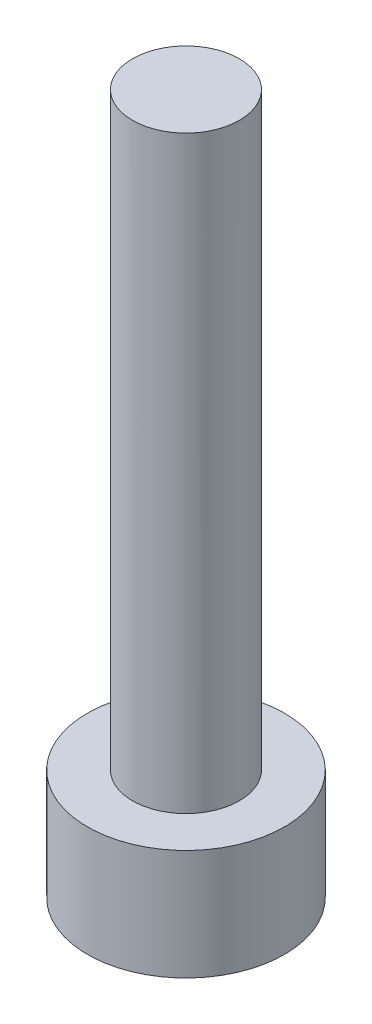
from build123d import *

# Parameters (mm, degrees)
SKETCH1_R           = 1.45
BOSS_EXTRUDE1_DEPTH = 16
SKETCH2_R           = 2.675
BOSS_EXTRUDE2_DEPTH = 3
CUT_EXTRUDE1_DEPTH  = 2


with BuildPart() as part:
    # Sketch1 → Boss-Extrude1 (new body)
    with BuildSketch(Plane(origin=(0, 0, 0), x_dir=(1, 0, 0), z_dir=(0, 1, 0))):
        with Locations(Location((0, 0, 0), (0, 0, 270))):
            Circle(SKETCH1_R)
    extrude(amount=BOSS_EXTRUDE1_DEPTH)

    # Sketch2 → Boss-Extrude2 (add)
    with BuildSketch(Plane.XZ):
        with Locations(Location((0, 0, 0), (0, 0, 270))):
            Circle(SKETCH2_R)
    extrude(amount=BOSS_EXTRUDE2_DEPTH)

    # Sketch3 → Cut-Extrude1 (cut)
    with BuildSketch(Plane.XZ.offset(3)):
        Polygon((1.661945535, 0.487787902), (0.408536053, 1.683181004), (-1.253409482, 1.195393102), (-1.661945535, -0.487787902), (-0.408536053, -1.683181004), (1.253409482, -1.195393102), align=None)
    extrude(amount=-CUT_EXTRUDE1_DEPTH, mode=Mode.SUBTRACT)


solid = part.part
